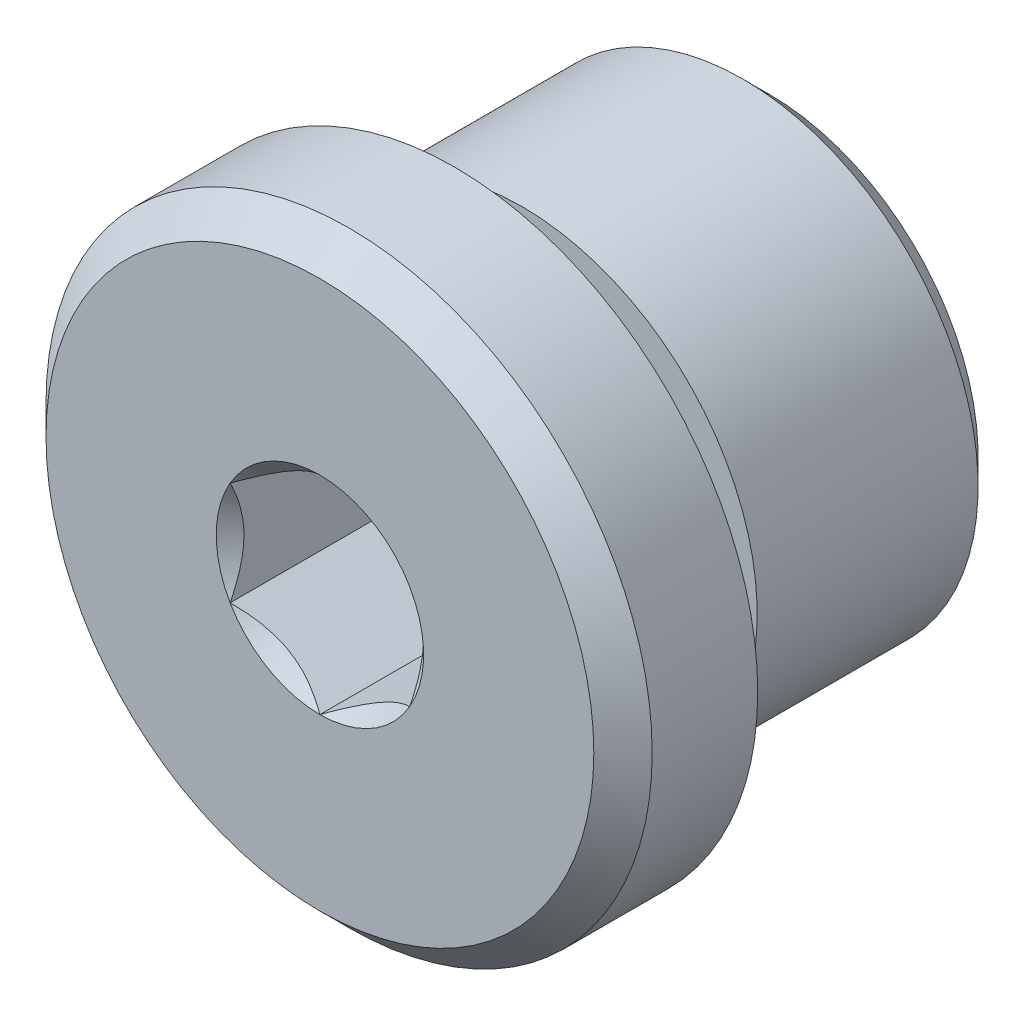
ISO-10303-21;
HEADER;
FILE_DESCRIPTION(('STEP AP214'),'2;1');
FILE_NAME('part.step','',(''),(''),'','','');
FILE_SCHEMA(('AUTOMOTIVE_DESIGN { 1 0 10303 214 1 1 1 1 }'));
ENDSEC;
DATA;
#1=APPLICATION_CONTEXT('core data for automotive mechanical design processes');
#2=APPLICATION_PROTOCOL_DEFINITION('international standard','automotive_design',2000,#1);
#3=PRODUCT_CONTEXT('',#1,'mechanical');
#4=PRODUCT('Part','Part','',(#3));
#5=PRODUCT_RELATED_PRODUCT_CATEGORY('part','',(#4));
#6=PRODUCT_DEFINITION_FORMATION('','',#4);
#7=PRODUCT_DEFINITION_CONTEXT('part definition',#1,'design');
#8=PRODUCT_DEFINITION('design','',#6,#7);
#9=PRODUCT_DEFINITION_SHAPE('','',#8);
#10=(LENGTH_UNIT() NAMED_UNIT(*) SI_UNIT(.MILLI.,.METRE.));
#11=(NAMED_UNIT(*) PLANE_ANGLE_UNIT() SI_UNIT($,.RADIAN.));
#12=(NAMED_UNIT(*) SI_UNIT($,.STERADIAN.) SOLID_ANGLE_UNIT());
#13=UNCERTAINTY_MEASURE_WITH_UNIT(LENGTH_MEASURE(1.E-05),#10,'distance_accuracy_value','');
#14=(GEOMETRIC_REPRESENTATION_CONTEXT(3) GLOBAL_UNCERTAINTY_ASSIGNED_CONTEXT((#13)) GLOBAL_UNIT_ASSIGNED_CONTEXT((#10,
#11,#12)) REPRESENTATION_CONTEXT('',''));
#15=CARTESIAN_POINT('',(0.,0.,0.));
#16=DIRECTION('',(0.,0.,1.));
#17=DIRECTION('',(1.,0.,0.));
#18=AXIS2_PLACEMENT_3D('',#15,#16,#17);
#19=CARTESIAN_POINT('',(0.,0.,-4.));
#20=DIRECTION('',(0.,0.,1.));
#21=DIRECTION('',(0.,-1.,0.));
#22=AXIS2_PLACEMENT_3D('',#19,#20,#21);
#23=PLANE('',#22);
#24=DIRECTION('',(-0.866025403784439,0.5,0.));
#25=VECTOR('',#24,1.);
#26=CARTESIAN_POINT('',(4.,2.3094010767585,-4.));
#27=LINE('',#26,#25);
#28=CARTESIAN_POINT('',(4.,2.3094010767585,-4.));
#29=VERTEX_POINT('',#28);
#30=CARTESIAN_POINT('',(0.,4.61880215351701,-4.));
#31=VERTEX_POINT('',#30);
#32=EDGE_CURVE('E64',#29,#31,#27,.T.);
#33=ORIENTED_EDGE('',*,*,#32,.T.);
#34=DIRECTION('',(-0.866025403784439,-0.5,0.));
#35=VECTOR('',#34,1.);
#36=CARTESIAN_POINT('',(0.,4.61880215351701,-4.));
#37=LINE('',#36,#35);
#38=CARTESIAN_POINT('',(-4.,2.3094010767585,-4.));
#39=VERTEX_POINT('',#38);
#40=EDGE_CURVE('E78',#31,#39,#37,.T.);
#41=ORIENTED_EDGE('',*,*,#40,.T.);
#42=DIRECTION('',(0.,-1.,0.));
#43=VECTOR('',#42,1.);
#44=CARTESIAN_POINT('',(-4.,2.3094010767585,-4.));
#45=LINE('',#44,#43);
#46=CARTESIAN_POINT('',(-4.,-2.3094010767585,-4.));
#47=VERTEX_POINT('',#46);
#48=EDGE_CURVE('E81',#39,#47,#45,.T.);
#49=ORIENTED_EDGE('',*,*,#48,.T.);
#50=DIRECTION('',(0.866025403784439,-0.5,0.));
#51=VECTOR('',#50,1.);
#52=CARTESIAN_POINT('',(-4.,-2.3094010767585,-4.));
#53=LINE('',#52,#51);
#54=CARTESIAN_POINT('',(0.,-4.61880215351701,-4.));
#55=VERTEX_POINT('',#54);
#56=EDGE_CURVE('E96',#47,#55,#53,.T.);
#57=ORIENTED_EDGE('',*,*,#56,.T.);
#58=DIRECTION('',(0.866025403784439,0.5,0.));
#59=VECTOR('',#58,1.);
#60=CARTESIAN_POINT('',(0.,-4.61880215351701,-4.));
#61=LINE('',#60,#59);
#62=CARTESIAN_POINT('',(4.,-2.3094010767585,-4.));
#63=VERTEX_POINT('',#62);
#64=EDGE_CURVE('E272',#55,#63,#61,.T.);
#65=ORIENTED_EDGE('',*,*,#64,.T.);
#66=DIRECTION('',(0.,1.,0.));
#67=VECTOR('',#66,1.);
#68=CARTESIAN_POINT('',(4.,-2.3094010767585,-4.));
#69=LINE('',#68,#67);
#70=EDGE_CURVE('E69',#63,#29,#69,.T.);
#71=ORIENTED_EDGE('',*,*,#70,.T.);
#72=EDGE_LOOP('',(#33,#41,#49,#57,#65,#71));
#73=FACE_BOUND('',#72,.T.);
#74=ADVANCED_FACE('F14',(#73),#23,.T.);
#75=CARTESIAN_POINT('',(0.,4.61880215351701,-4.));
#76=DIRECTION('',(-0.5,0.866025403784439,0.));
#77=DIRECTION('',(-0.866025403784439,-0.5,0.));
#78=AXIS2_PLACEMENT_3D('',#75,#76,#77);
#79=PLANE('',#78);
#80=ORIENTED_EDGE('',*,*,#40,.F.);
#81=DIRECTION('',(0.,0.,1.));
#82=VECTOR('',#81,1.);
#83=CARTESIAN_POINT('',(0.,4.61880215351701,-4.));
#84=LINE('',#83,#82);
#85=CARTESIAN_POINT('',(0.,4.61880215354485,5.99999999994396));
#86=VERTEX_POINT('',#85);
#87=EDGE_CURVE('E56',#31,#86,#84,.T.);
#88=ORIENTED_EDGE('',*,*,#87,.T.);
#89=CARTESIAN_POINT('',(3.50611918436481E-11,4.6188021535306,5.99999999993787));
#90=CARTESIAN_POINT('',(-0.0687749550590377,4.57909491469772,5.96029983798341));
#91=CARTESIAN_POINT('',(-0.138076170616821,4.53908383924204,5.92181777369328));
#92=CARTESIAN_POINT('',(-0.277839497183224,4.45839144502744,5.84766109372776));
#93=CARTESIAN_POINT('',(-0.348302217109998,4.41770977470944,5.81198801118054));
#94=CARTESIAN_POINT('',(-0.562249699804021,4.2941871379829,5.70943498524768));
#95=CARTESIAN_POINT('',(-0.707552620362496,4.21029645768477,5.64745868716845));
#96=CARTESIAN_POINT('',(-1.00051065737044,4.04115705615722,5.54132160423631));
#97=CARTESIAN_POINT('',(-1.14809180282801,3.95595104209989,5.49689359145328));
#98=CARTESIAN_POINT('',(-1.44651232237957,3.78365787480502,5.42843759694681));
#99=CARTESIAN_POINT('',(-1.59734256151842,3.6965759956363,5.40435855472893));
#100=CARTESIAN_POINT('',(-1.85730247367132,3.54648807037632,5.38263320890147));
#101=CARTESIAN_POINT('',(-1.96609737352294,3.48367530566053,5.37941854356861));
#102=CARTESIAN_POINT('',(-2.18351048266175,3.35815178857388,5.38484214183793));
#103=CARTESIAN_POINT('',(-2.29212861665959,3.29544107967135,5.39348455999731));
#104=CARTESIAN_POINT('',(-2.50833558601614,3.17061392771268,5.42212936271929));
#105=CARTESIAN_POINT('',(-2.6159231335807,3.10849822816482,5.44214444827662));
#106=CARTESIAN_POINT('',(-2.82925043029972,2.9853336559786,5.49244202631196));
#107=CARTESIAN_POINT('',(-2.93499032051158,2.9242847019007,5.52272373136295));
#108=CARTESIAN_POINT('',(-3.1226843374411,2.81591951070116,5.58501828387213));
#109=CARTESIAN_POINT('',(-3.20505440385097,2.76836313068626,5.61539181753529));
#110=CARTESIAN_POINT('',(-3.36831619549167,2.67410389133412,5.68103271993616));
#111=CARTESIAN_POINT('',(-3.44920787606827,2.62740105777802,5.71630023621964));
#112=CARTESIAN_POINT('',(-3.60925800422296,2.53499607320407,5.7909387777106));
#113=CARTESIAN_POINT('',(-3.6884210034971,2.48929129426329,5.83029689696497));
#114=CARTESIAN_POINT('',(-3.84528136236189,2.39872792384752,5.91260007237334));
#115=CARTESIAN_POINT('',(-3.92297958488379,2.35386883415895,5.95554293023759));
#116=CARTESIAN_POINT('',(-4.00000000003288,2.30940107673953,5.99999999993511));
#117=B_SPLINE_CURVE_WITH_KNOTS('',3,(#89,#90,#91,#92,#93,#94,#95,#96,#97,#98,#99,#100,#101,#102,
#103,#104,#105,#106,#107,#108,#109,#110,#111,#112,#113,#114,#115,#116),.UNSPECIFIED.,.F.,.F.,(4,
2,2,2,2,2,2,2,2,2,2,2,2,4),(0.,0.266334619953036,0.53281361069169,1.06864799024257,
1.59597513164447,2.12197511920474,2.49844327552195,2.87504337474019,3.25206488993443,
3.62905749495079,3.92845163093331,4.22785479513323,4.52634046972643,4.82464442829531),.UNSPECIFIED.);
#118=CARTESIAN_POINT('',(-4.00000000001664,2.30940107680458,5.99999999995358));
#119=VERTEX_POINT('',#118);
#120=EDGE_CURVE('E17',#86,#119,#117,.T.);
#121=ORIENTED_EDGE('',*,*,#120,.T.);
#122=DIRECTION('',(0.,0.,1.));
#123=VECTOR('',#122,1.);
#124=CARTESIAN_POINT('',(-4.,2.3094010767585,-4.));
#125=LINE('',#124,#123);
#126=EDGE_CURVE('E83',#119,#39,#125,.F.);
#127=ORIENTED_EDGE('',*,*,#126,.T.);
#128=EDGE_LOOP('',(#80,#88,#121,#127));
#129=FACE_BOUND('',#128,.T.);
#130=ADVANCED_FACE('F86',(#129),#79,.F.);
#131=CARTESIAN_POINT('',(-4.,2.3094010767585,-4.));
#132=DIRECTION('',(-1.,0.,0.));
#133=DIRECTION('',(0.,-1.,0.));
#134=AXIS2_PLACEMENT_3D('',#131,#132,#133);
#135=PLANE('',#134);
#136=ORIENTED_EDGE('',*,*,#48,.F.);
#137=ORIENTED_EDGE('',*,*,#126,.F.);
#138=CARTESIAN_POINT('',(-3.99999999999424,2.30940107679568,5.99999999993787));
#139=CARTESIAN_POINT('',(-3.99999999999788,2.22998659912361,5.96029983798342));
#140=CARTESIAN_POINT('',(-3.99999999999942,2.14996444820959,5.92181777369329));
#141=CARTESIAN_POINT('',(-4.00000000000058,1.98857965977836,5.84766109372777));
#142=CARTESIAN_POINT('',(-4.0000000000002,1.90721631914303,5.81198801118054));
#143=CARTESIAN_POINT('',(-3.99999999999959,1.660171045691,5.70943498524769));
#144=CARTESIAN_POINT('',(-3.99999999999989,1.49238968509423,5.64745868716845));
#145=CARTESIAN_POINT('',(-4.00000000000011,1.15411088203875,5.54132160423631));
#146=CARTESIAN_POINT('',(-4.00000000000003,0.983698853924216,5.49689359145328));
#147=CARTESIAN_POINT('',(-3.99999999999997,0.63911251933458,5.42843759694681));
#148=CARTESIAN_POINT('',(-3.99999999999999,0.464948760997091,5.40435855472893));
#149=CARTESIAN_POINT('',(-4.,0.164772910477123,5.38263320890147));
#150=CARTESIAN_POINT('',(-4.,0.0391473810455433,5.37941854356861));
#151=CARTESIAN_POINT('',(-4.,-0.211899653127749,5.38484214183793));
#152=CARTESIAN_POINT('',(-4.,-0.337321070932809,5.3934845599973));
#153=CARTESIAN_POINT('',(-4.,-0.586975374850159,5.42212936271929));
#154=CARTESIAN_POINT('',(-4.,-0.711206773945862,5.44214444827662));
#155=CARTESIAN_POINT('',(-4.,-0.957535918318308,5.49244202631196));
#156=CARTESIAN_POINT('',(-4.,-1.07963382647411,5.52272373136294));
#157=CARTESIAN_POINT('',(-4.,-1.29636420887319,5.58501828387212));
#158=CARTESIAN_POINT('',(-4.,-1.391476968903,5.61539181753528));
#159=CARTESIAN_POINT('',(-4.,-1.57999544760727,5.68103271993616));
#160=CARTESIAN_POINT('',(-4.,-1.67340111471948,5.71630023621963));
#161=CARTESIAN_POINT('',(-4.,-1.85821108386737,5.7909387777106));
#162=CARTESIAN_POINT('',(-4.,-1.94962064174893,5.83029689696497));
#163=CARTESIAN_POINT('',(-4.,-2.13074738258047,5.91260007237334));
#164=CARTESIAN_POINT('',(-4.,-2.22046556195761,5.95554293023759));
#165=CARTESIAN_POINT('',(-4.,-2.30940107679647,5.99999999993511));
#166=B_SPLINE_CURVE_WITH_KNOTS('',3,(#138,#139,#140,#141,#142,#143,#144,#145,#146,#147,#148,
#149,#150,#151,#152,#153,#154,#155,#156,#157,#158,#159,#160,#161,#162,#163,#164,#165),
.UNSPECIFIED.,.F.,.F.,(4,2,2,2,2,2,2,2,2,2,2,2,2,4),(0.,0.266334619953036,0.532813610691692,
1.06864799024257,1.59597513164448,2.12197511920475,2.49844327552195,2.87504337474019,
3.25206488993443,3.62905749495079,3.92845163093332,4.22785479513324,4.52634046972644,
4.82464442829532),.UNSPECIFIED.);
#167=CARTESIAN_POINT('',(-4.00000000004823,-2.30940107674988,5.99999999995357));
#168=VERTEX_POINT('',#167);
#169=EDGE_CURVE('E204',#119,#168,#166,.T.);
#170=ORIENTED_EDGE('',*,*,#169,.T.);
#171=DIRECTION('',(0.,0.,1.));
#172=VECTOR('',#171,1.);
#173=CARTESIAN_POINT('',(-4.,-2.3094010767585,-4.));
#174=LINE('',#173,#172);
#175=EDGE_CURVE('E93',#168,#47,#174,.F.);
#176=ORIENTED_EDGE('',*,*,#175,.T.);
#177=EDGE_LOOP('',(#136,#137,#170,#176));
#178=FACE_BOUND('',#177,.T.);
#179=ADVANCED_FACE('F91',(#178),#135,.F.);
#180=CARTESIAN_POINT('',(-4.,-2.3094010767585,-4.));
#181=DIRECTION('',(-0.5,-0.866025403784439,0.));
#182=DIRECTION('',(0.866025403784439,-0.5,0.));
#183=AXIS2_PLACEMENT_3D('',#180,#181,#182);
#184=PLANE('',#183);
#185=ORIENTED_EDGE('',*,*,#56,.F.);
#186=ORIENTED_EDGE('',*,*,#175,.F.);
#187=CARTESIAN_POINT('',(-4.00000000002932,-2.30940107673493,5.99999999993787));
#188=CARTESIAN_POINT('',(-3.93122504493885,-2.34910831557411,5.96029983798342));
#189=CARTESIAN_POINT('',(-3.86192382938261,-2.38911939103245,5.92181777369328));
#190=CARTESIAN_POINT('',(-3.72216050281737,-2.46981178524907,5.84766109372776));
#191=CARTESIAN_POINT('',(-3.65169778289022,-2.51049345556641,5.81198801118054));
#192=CARTESIAN_POINT('',(-3.43775030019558,-2.6340160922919,5.70943498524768));
#193=CARTESIAN_POINT('',(-3.29244737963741,-2.71790677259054,5.64745868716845));
#194=CARTESIAN_POINT('',(-2.99948934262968,-2.88704617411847,5.54132160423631));
#195=CARTESIAN_POINT('',(-2.85190819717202,-2.97225218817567,5.49689359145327));
#196=CARTESIAN_POINT('',(-2.55348767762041,-3.14454535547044,5.42843759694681));
#197=CARTESIAN_POINT('',(-2.40265743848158,-3.2316272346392,5.40435855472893));
#198=CARTESIAN_POINT('',(-2.14269752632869,-3.3817151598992,5.38263320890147));
#199=CARTESIAN_POINT('',(-2.03390262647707,-3.44452792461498,5.3794185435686));
#200=CARTESIAN_POINT('',(-1.81648951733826,-3.57005144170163,5.38484214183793));
#201=CARTESIAN_POINT('',(-1.70787138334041,-3.63276215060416,5.3934845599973));
#202=CARTESIAN_POINT('',(-1.49166441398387,-3.75758930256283,5.42212936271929));
#203=CARTESIAN_POINT('',(-1.38407686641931,-3.81970500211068,5.44214444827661));
#204=CARTESIAN_POINT('',(-1.17074956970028,-3.94286957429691,5.49244202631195));
#205=CARTESIAN_POINT('',(-1.06500967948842,-4.0039185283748,5.52272373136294));
#206=CARTESIAN_POINT('',(-0.877315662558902,-4.11228371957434,5.58501828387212));
#207=CARTESIAN_POINT('',(-0.79494559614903,-4.15984009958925,5.61539181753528));
#208=CARTESIAN_POINT('',(-0.631683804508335,-4.25409933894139,5.68103271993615));
#209=CARTESIAN_POINT('',(-0.550792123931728,-4.30080217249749,5.71630023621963));
#210=CARTESIAN_POINT('',(-0.390741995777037,-4.39320715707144,5.79093877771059));
#211=CARTESIAN_POINT('',(-0.3115789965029,-4.43891193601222,5.83029689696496));
#212=CARTESIAN_POINT('',(-0.15471863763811,-4.52947530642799,5.91260007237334));
#213=CARTESIAN_POINT('',(-0.0770204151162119,-4.57433439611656,5.95554293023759));
#214=CARTESIAN_POINT('',(3.2885622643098E-11,-4.61880215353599,5.99999999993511));
#215=B_SPLINE_CURVE_WITH_KNOTS('',3,(#187,#188,#189,#190,#191,#192,#193,#194,#195,#196,#197,
#198,#199,#200,#201,#202,#203,#204,#205,#206,#207,#208,#209,#210,#211,#212,#213,#214),
.UNSPECIFIED.,.F.,.F.,(4,2,2,2,2,2,2,2,2,2,2,2,2,4),(0.,0.266334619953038,0.532813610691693,
1.06864799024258,1.59597513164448,2.12197511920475,2.49844327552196,2.8750433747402,
3.25206488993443,3.6290574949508,3.92845163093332,4.22785479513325,4.52634046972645,
4.82464442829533),.UNSPECIFIED.);
#216=CARTESIAN_POINT('',(-3.15715938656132E-11,-4.61880215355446,5.99999999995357));
#217=VERTEX_POINT('',#216);
#218=EDGE_CURVE('E184',#168,#217,#215,.T.);
#219=ORIENTED_EDGE('',*,*,#218,.T.);
#220=DIRECTION('',(0.,0.,1.));
#221=VECTOR('',#220,1.);
#222=CARTESIAN_POINT('',(0.,-4.61880215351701,-4.));
#223=LINE('',#222,#221);
#224=EDGE_CURVE('E273',#217,#55,#223,.F.);
#225=ORIENTED_EDGE('',*,*,#224,.T.);
#226=EDGE_LOOP('',(#185,#186,#219,#225));
#227=FACE_BOUND('',#226,.T.);
#228=ADVANCED_FACE('F194',(#227),#184,.F.);
#229=CARTESIAN_POINT('',(0.,-4.61880215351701,-4.));
#230=DIRECTION('',(0.5,-0.866025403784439,0.));
#231=DIRECTION('',(0.866025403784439,0.5,0.));
#232=AXIS2_PLACEMENT_3D('',#229,#230,#231);
#233=PLANE('',#232);
#234=ORIENTED_EDGE('',*,*,#64,.F.);
#235=ORIENTED_EDGE('',*,*,#224,.F.);
#236=CARTESIAN_POINT('',(-3.50711385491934E-11,-4.61880215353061,5.99999999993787));
#237=CARTESIAN_POINT('',(0.0687749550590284,-4.57909491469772,5.96029983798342));
#238=CARTESIAN_POINT('',(0.138076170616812,-4.53908383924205,5.92181777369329));
#239=CARTESIAN_POINT('',(0.277839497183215,-4.45839144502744,5.84766109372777));
#240=CARTESIAN_POINT('',(0.348302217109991,-4.41770977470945,5.81198801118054));
#241=CARTESIAN_POINT('',(0.562249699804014,-4.2941871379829,5.70943498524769));
#242=CARTESIAN_POINT('',(0.707552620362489,-4.21029645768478,5.64745868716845));
#243=CARTESIAN_POINT('',(1.00051065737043,-4.04115705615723,5.54132160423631));
#244=CARTESIAN_POINT('',(1.14809180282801,-3.95595104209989,5.49689359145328));
#245=CARTESIAN_POINT('',(1.44651232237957,-3.78365787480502,5.42843759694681));
#246=CARTESIAN_POINT('',(1.59734256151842,-3.6965759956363,5.40435855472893));
#247=CARTESIAN_POINT('',(1.85730247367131,-3.54648807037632,5.38263320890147));
#248=CARTESIAN_POINT('',(1.96609737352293,-3.48367530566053,5.37941854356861));
#249=CARTESIAN_POINT('',(2.18351048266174,-3.35815178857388,5.38484214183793));
#250=CARTESIAN_POINT('',(2.29212861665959,-3.29544107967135,5.3934845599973));
#251=CARTESIAN_POINT('',(2.50833558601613,-3.17061392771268,5.42212936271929));
#252=CARTESIAN_POINT('',(2.61592313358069,-3.10849822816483,5.44214444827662));
#253=CARTESIAN_POINT('',(2.82925043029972,-2.9853336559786,5.49244202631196));
#254=CARTESIAN_POINT('',(2.93499032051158,-2.92428470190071,5.52272373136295));
#255=CARTESIAN_POINT('',(3.1226843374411,-2.81591951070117,5.58501828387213));
#256=CARTESIAN_POINT('',(3.20505440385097,-2.76836313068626,5.61539181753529));
#257=CARTESIAN_POINT('',(3.36831619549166,-2.67410389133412,5.68103271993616));
#258=CARTESIAN_POINT('',(3.44920787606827,-2.62740105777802,5.71630023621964));
#259=CARTESIAN_POINT('',(3.60925800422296,-2.53499607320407,5.7909387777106));
#260=CARTESIAN_POINT('',(3.6884210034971,-2.48929129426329,5.83029689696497));
#261=CARTESIAN_POINT('',(3.84528136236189,-2.39872792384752,5.91260007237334));
#262=CARTESIAN_POINT('',(3.92297958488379,-2.35386883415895,5.95554293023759));
#263=CARTESIAN_POINT('',(4.00000000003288,-2.30940107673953,5.99999999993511));
#264=B_SPLINE_CURVE_WITH_KNOTS('',3,(#236,#237,#238,#239,#240,#241,#242,#243,#244,#245,#246,
#247,#248,#249,#250,#251,#252,#253,#254,#255,#256,#257,#258,#259,#260,#261,#262,#263),
.UNSPECIFIED.,.F.,.F.,(4,2,2,2,2,2,2,2,2,2,2,2,2,4),(0.,0.266334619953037,0.532813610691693,
1.06864799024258,1.59597513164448,2.12197511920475,2.49844327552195,2.87504337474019,
3.25206488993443,3.62905749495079,3.92845163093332,4.22785479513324,4.52634046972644,
4.82464442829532),.UNSPECIFIED.);
#265=CARTESIAN_POINT('',(4.00000000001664,-2.30940107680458,5.99999999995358));
#266=VERTEX_POINT('',#265);
#267=EDGE_CURVE('E177',#217,#266,#264,.T.);
#268=ORIENTED_EDGE('',*,*,#267,.T.);
#269=DIRECTION('',(0.,0.,1.));
#270=VECTOR('',#269,1.);
#271=CARTESIAN_POINT('',(4.,-2.3094010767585,-4.));
#272=LINE('',#271,#270);
#273=EDGE_CURVE('E269',#266,#63,#272,.F.);
#274=ORIENTED_EDGE('',*,*,#273,.T.);
#275=EDGE_LOOP('',(#234,#235,#268,#274));
#276=FACE_BOUND('',#275,.T.);
#277=ADVANCED_FACE('F190',(#276),#233,.F.);
#278=CARTESIAN_POINT('',(4.,-2.3094010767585,-4.));
#279=DIRECTION('',(1.,0.,0.));
#280=DIRECTION('',(0.,1.,0.));
#281=AXIS2_PLACEMENT_3D('',#278,#279,#280);
#282=PLANE('',#281);
#283=ORIENTED_EDGE('',*,*,#70,.F.);
#284=ORIENTED_EDGE('',*,*,#273,.F.);
#285=CARTESIAN_POINT('',(3.99999999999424,-2.30940107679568,5.99999999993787));
#286=CARTESIAN_POINT('',(3.99999999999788,-2.22998659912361,5.96029983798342));
#287=CARTESIAN_POINT('',(3.99999999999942,-2.14996444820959,5.92181777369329));
#288=CARTESIAN_POINT('',(4.00000000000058,-1.98857965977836,5.84766109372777));
#289=CARTESIAN_POINT('',(4.0000000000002,-1.90721631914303,5.81198801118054));
#290=CARTESIAN_POINT('',(3.99999999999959,-1.660171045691,5.70943498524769));
#291=CARTESIAN_POINT('',(3.99999999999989,-1.49238968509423,5.64745868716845));
#292=CARTESIAN_POINT('',(4.00000000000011,-1.15411088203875,5.54132160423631));
#293=CARTESIAN_POINT('',(4.00000000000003,-0.983698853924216,5.49689359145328));
#294=CARTESIAN_POINT('',(3.99999999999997,-0.63911251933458,5.42843759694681));
#295=CARTESIAN_POINT('',(3.99999999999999,-0.464948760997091,5.40435855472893));
#296=CARTESIAN_POINT('',(4.,-0.164772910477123,5.38263320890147));
#297=CARTESIAN_POINT('',(4.,-0.0391473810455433,5.37941854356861));
#298=CARTESIAN_POINT('',(4.,0.211899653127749,5.38484214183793));
#299=CARTESIAN_POINT('',(4.,0.337321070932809,5.3934845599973));
#300=CARTESIAN_POINT('',(4.,0.586975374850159,5.42212936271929));
#301=CARTESIAN_POINT('',(4.,0.711206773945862,5.44214444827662));
#302=CARTESIAN_POINT('',(4.,0.957535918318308,5.49244202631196));
#303=CARTESIAN_POINT('',(4.,1.07963382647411,5.52272373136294));
#304=CARTESIAN_POINT('',(4.,1.29636420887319,5.58501828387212));
#305=CARTESIAN_POINT('',(4.,1.391476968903,5.61539181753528));
#306=CARTESIAN_POINT('',(4.,1.57999544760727,5.68103271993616));
#307=CARTESIAN_POINT('',(4.,1.67340111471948,5.71630023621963));
#308=CARTESIAN_POINT('',(4.,1.85821108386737,5.7909387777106));
#309=CARTESIAN_POINT('',(4.,1.94962064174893,5.83029689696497));
#310=CARTESIAN_POINT('',(4.,2.13074738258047,5.91260007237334));
#311=CARTESIAN_POINT('',(4.,2.22046556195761,5.95554293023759));
#312=CARTESIAN_POINT('',(4.,2.30940107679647,5.99999999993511));
#313=B_SPLINE_CURVE_WITH_KNOTS('',3,(#285,#286,#287,#288,#289,#290,#291,#292,#293,#294,#295,
#296,#297,#298,#299,#300,#301,#302,#303,#304,#305,#306,#307,#308,#309,#310,#311,#312),
.UNSPECIFIED.,.F.,.F.,(4,2,2,2,2,2,2,2,2,2,2,2,2,4),(0.,0.266334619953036,0.532813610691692,
1.06864799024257,1.59597513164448,2.12197511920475,2.49844327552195,2.87504337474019,
3.25206488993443,3.62905749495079,3.92845163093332,4.22785479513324,4.52634046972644,
4.82464442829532),.UNSPECIFIED.);
#314=CARTESIAN_POINT('',(4.00000000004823,2.30940107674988,5.99999999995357));
#315=VERTEX_POINT('',#314);
#316=EDGE_CURVE('E37',#266,#315,#313,.T.);
#317=ORIENTED_EDGE('',*,*,#316,.T.);
#318=DIRECTION('',(0.,0.,1.));
#319=VECTOR('',#318,1.);
#320=CARTESIAN_POINT('',(4.,2.3094010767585,-4.));
#321=LINE('',#320,#319);
#322=EDGE_CURVE('E267',#315,#29,#321,.F.);
#323=ORIENTED_EDGE('',*,*,#322,.T.);
#324=EDGE_LOOP('',(#283,#284,#317,#323));
#325=FACE_BOUND('',#324,.T.);
#326=ADVANCED_FACE('F193',(#325),#282,.F.);
#327=CARTESIAN_POINT('',(4.,2.3094010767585,-4.));
#328=DIRECTION('',(0.5,0.866025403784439,0.));
#329=DIRECTION('',(-0.866025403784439,0.5,0.));
#330=AXIS2_PLACEMENT_3D('',#327,#328,#329);
#331=PLANE('',#330);
#332=ORIENTED_EDGE('',*,*,#32,.F.);
#333=ORIENTED_EDGE('',*,*,#322,.F.);
#334=CARTESIAN_POINT('',(4.00000000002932,2.30940107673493,5.99999999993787));
#335=CARTESIAN_POINT('',(3.93122504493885,2.34910831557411,5.96029983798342));
#336=CARTESIAN_POINT('',(3.86192382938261,2.38911939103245,5.92181777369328));
#337=CARTESIAN_POINT('',(3.72216050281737,2.46981178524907,5.84766109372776));
#338=CARTESIAN_POINT('',(3.65169778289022,2.51049345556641,5.81198801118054));
#339=CARTESIAN_POINT('',(3.43775030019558,2.6340160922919,5.70943498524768));
#340=CARTESIAN_POINT('',(3.29244737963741,2.71790677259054,5.64745868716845));
#341=CARTESIAN_POINT('',(2.99948934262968,2.88704617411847,5.54132160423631));
#342=CARTESIAN_POINT('',(2.85190819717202,2.97225218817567,5.49689359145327));
#343=CARTESIAN_POINT('',(2.55348767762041,3.14454535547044,5.42843759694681));
#344=CARTESIAN_POINT('',(2.40265743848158,3.2316272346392,5.40435855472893));
#345=CARTESIAN_POINT('',(2.14269752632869,3.3817151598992,5.38263320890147));
#346=CARTESIAN_POINT('',(2.03390262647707,3.44452792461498,5.3794185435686));
#347=CARTESIAN_POINT('',(1.81648951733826,3.57005144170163,5.38484214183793));
#348=CARTESIAN_POINT('',(1.70787138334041,3.63276215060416,5.3934845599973));
#349=CARTESIAN_POINT('',(1.49166441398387,3.75758930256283,5.42212936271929));
#350=CARTESIAN_POINT('',(1.38407686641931,3.81970500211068,5.44214444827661));
#351=CARTESIAN_POINT('',(1.17074956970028,3.94286957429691,5.49244202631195));
#352=CARTESIAN_POINT('',(1.06500967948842,4.0039185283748,5.52272373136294));
#353=CARTESIAN_POINT('',(0.877315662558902,4.11228371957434,5.58501828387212));
#354=CARTESIAN_POINT('',(0.79494559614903,4.15984009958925,5.61539181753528));
#355=CARTESIAN_POINT('',(0.631683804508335,4.25409933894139,5.68103271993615));
#356=CARTESIAN_POINT('',(0.550792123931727,4.30080217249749,5.71630023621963));
#357=CARTESIAN_POINT('',(0.390741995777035,4.39320715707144,5.7909387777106));
#358=CARTESIAN_POINT('',(0.311578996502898,4.43891193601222,5.83029689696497));
#359=CARTESIAN_POINT('',(0.154718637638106,4.52947530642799,5.91260007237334));
#360=CARTESIAN_POINT('',(0.0770204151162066,4.57433439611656,5.95554293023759));
#361=CARTESIAN_POINT('',(-3.28929245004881E-11,4.61880215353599,5.99999999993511));
#362=B_SPLINE_CURVE_WITH_KNOTS('',3,(#334,#335,#336,#337,#338,#339,#340,#341,#342,#343,#344,
#345,#346,#347,#348,#349,#350,#351,#352,#353,#354,#355,#356,#357,#358,#359,#360,#361),
.UNSPECIFIED.,.F.,.F.,(4,2,2,2,2,2,2,2,2,2,2,2,2,4),(0.,0.266334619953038,0.532813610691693,
1.06864799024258,1.59597513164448,2.12197511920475,2.49844327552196,2.8750433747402,
3.25206488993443,3.62905749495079,3.92845163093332,4.22785479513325,4.52634046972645,
4.82464442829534),.UNSPECIFIED.);
#363=EDGE_CURVE('E140',#315,#86,#362,.T.);
#364=ORIENTED_EDGE('',*,*,#363,.T.);
#365=ORIENTED_EDGE('',*,*,#87,.F.);
#366=EDGE_LOOP('',(#332,#333,#364,#365));
#367=FACE_BOUND('',#366,.T.);
#368=ADVANCED_FACE('F155',(#367),#331,.F.);
#369=CARTESIAN_POINT('',(0.,0.,5.99999999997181));
#370=DIRECTION('',(0.,0.,1.));
#371=DIRECTION('',(0.,-1.,0.));
#372=AXIS2_PLACEMENT_3D('',#369,#370,#371);
#373=CONICAL_SURFACE('',#372,4.61880215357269,0.785398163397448);
#374=ORIENTED_EDGE('',*,*,#120,.F.);
#375=CARTESIAN_POINT('',(0.,0.,5.99999999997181));
#376=DIRECTION('',(0.,0.,1.));
#377=DIRECTION('',(0.,-1.,0.));
#378=AXIS2_PLACEMENT_3D('',#375,#376,#377);
#379=CIRCLE('',#378,4.61880215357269);
#380=EDGE_CURVE('E138',#86,#119,#379,.T.);
#381=ORIENTED_EDGE('',*,*,#380,.T.);
#382=EDGE_LOOP('',(#374,#381));
#383=FACE_BOUND('',#382,.T.);
#384=ADVANCED_FACE('F212',(#383),#373,.F.);
#385=CARTESIAN_POINT('',(0.,0.,5.99999999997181));
#386=DIRECTION('',(0.,0.,1.));
#387=DIRECTION('',(0.,-1.,0.));
#388=AXIS2_PLACEMENT_3D('',#385,#386,#387);
#389=CONICAL_SURFACE('',#388,4.61880215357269,0.785398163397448);
#390=ORIENTED_EDGE('',*,*,#169,.F.);
#391=CARTESIAN_POINT('',(0.,0.,5.99999999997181));
#392=DIRECTION('',(0.,0.,1.));
#393=DIRECTION('',(0.,-1.,0.));
#394=AXIS2_PLACEMENT_3D('',#391,#392,#393);
#395=CIRCLE('',#394,4.61880215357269);
#396=EDGE_CURVE('E135',#119,#168,#395,.T.);
#397=ORIENTED_EDGE('',*,*,#396,.T.);
#398=EDGE_LOOP('',(#390,#397));
#399=FACE_BOUND('',#398,.T.);
#400=ADVANCED_FACE('F209',(#399),#389,.F.);
#401=CARTESIAN_POINT('',(0.,0.,5.99999999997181));
#402=DIRECTION('',(0.,0.,1.));
#403=DIRECTION('',(0.,-1.,0.));
#404=AXIS2_PLACEMENT_3D('',#401,#402,#403);
#405=CONICAL_SURFACE('',#404,4.61880215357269,0.785398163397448);
#406=ORIENTED_EDGE('',*,*,#218,.F.);
#407=CARTESIAN_POINT('',(0.,0.,5.99999999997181));
#408=DIRECTION('',(0.,0.,1.));
#409=DIRECTION('',(0.,-1.,0.));
#410=AXIS2_PLACEMENT_3D('',#407,#408,#409);
#411=CIRCLE('',#410,4.61880215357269);
#412=EDGE_CURVE('E132',#168,#217,#411,.T.);
#413=ORIENTED_EDGE('',*,*,#412,.T.);
#414=EDGE_LOOP('',(#406,#413));
#415=FACE_BOUND('',#414,.T.);
#416=ADVANCED_FACE('F173',(#415),#405,.F.);
#417=CARTESIAN_POINT('',(0.,0.,5.99999999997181));
#418=DIRECTION('',(0.,0.,1.));
#419=DIRECTION('',(0.,-1.,0.));
#420=AXIS2_PLACEMENT_3D('',#417,#418,#419);
#421=CONICAL_SURFACE('',#420,4.61880215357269,0.785398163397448);
#422=ORIENTED_EDGE('',*,*,#267,.F.);
#423=CARTESIAN_POINT('',(0.,0.,5.99999999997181));
#424=DIRECTION('',(0.,0.,1.));
#425=DIRECTION('',(0.,-1.,0.));
#426=AXIS2_PLACEMENT_3D('',#423,#424,#425);
#427=CIRCLE('',#426,4.61880215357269);
#428=EDGE_CURVE('E129',#217,#266,#427,.T.);
#429=ORIENTED_EDGE('',*,*,#428,.T.);
#430=EDGE_LOOP('',(#422,#429));
#431=FACE_BOUND('',#430,.T.);
#432=ADVANCED_FACE('F168',(#431),#421,.F.);
#433=CARTESIAN_POINT('',(0.,0.,5.99999999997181));
#434=DIRECTION('',(0.,0.,1.));
#435=DIRECTION('',(0.,-1.,0.));
#436=AXIS2_PLACEMENT_3D('',#433,#434,#435);
#437=CONICAL_SURFACE('',#436,4.61880215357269,0.785398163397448);
#438=ORIENTED_EDGE('',*,*,#316,.F.);
#439=CARTESIAN_POINT('',(0.,0.,5.99999999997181));
#440=DIRECTION('',(0.,0.,1.));
#441=DIRECTION('',(0.,-1.,0.));
#442=AXIS2_PLACEMENT_3D('',#439,#440,#441);
#443=CIRCLE('',#442,4.61880215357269);
#444=EDGE_CURVE('E126',#266,#315,#443,.T.);
#445=ORIENTED_EDGE('',*,*,#444,.T.);
#446=EDGE_LOOP('',(#438,#445));
#447=FACE_BOUND('',#446,.T.);
#448=ADVANCED_FACE('F162',(#447),#437,.F.);
#449=CARTESIAN_POINT('',(0.,0.,5.99999999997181));
#450=DIRECTION('',(0.,0.,1.));
#451=DIRECTION('',(0.,-1.,0.));
#452=AXIS2_PLACEMENT_3D('',#449,#450,#451);
#453=CONICAL_SURFACE('',#452,4.61880215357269,0.785398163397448);
#454=ORIENTED_EDGE('',*,*,#363,.F.);
#455=CARTESIAN_POINT('',(0.,0.,5.99999999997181));
#456=DIRECTION('',(0.,0.,1.));
#457=DIRECTION('',(0.,-1.,0.));
#458=AXIS2_PLACEMENT_3D('',#455,#456,#457);
#459=CIRCLE('',#458,4.61880215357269);
#460=EDGE_CURVE('E123',#315,#86,#459,.T.);
#461=ORIENTED_EDGE('',*,*,#460,.T.);
#462=EDGE_LOOP('',(#454,#461));
#463=FACE_BOUND('',#462,.T.);
#464=ADVANCED_FACE('F157',(#463),#453,.F.);
#465=CARTESIAN_POINT('',(4.618802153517,0.,6.));
#466=DIRECTION('',(0.,0.,-1.));
#467=DIRECTION('',(0.,1.,0.));
#468=AXIS2_PLACEMENT_3D('',#465,#466,#467);
#469=PLANE('',#468);
#470=ORIENTED_EDGE('',*,*,#444,.F.);
#471=ORIENTED_EDGE('',*,*,#428,.F.);
#472=ORIENTED_EDGE('',*,*,#412,.F.);
#473=ORIENTED_EDGE('',*,*,#396,.F.);
#474=ORIENTED_EDGE('',*,*,#380,.F.);
#475=ORIENTED_EDGE('',*,*,#460,.F.);
#476=EDGE_LOOP('',(#470,#471,#472,#473,#474,#475));
#477=FACE_BOUND('',#476,.T.);
#478=CARTESIAN_POINT('',(0.,0.,6.));
#479=DIRECTION('',(0.,0.,-1.));
#480=DIRECTION('',(0.,1.,0.));
#481=AXIS2_PLACEMENT_3D('',#478,#479,#480);
#482=CIRCLE('',#481,12.2);
#483=CARTESIAN_POINT('',(0.,12.2,6.));
#484=VERTEX_POINT('',#483);
#485=EDGE_CURVE('E120',#484,#484,#482,.T.);
#486=ORIENTED_EDGE('',*,*,#485,.F.);
#487=EDGE_LOOP('',(#486));
#488=FACE_BOUND('',#487,.T.);
#489=ADVANCED_FACE('F161',(#477,#488),#469,.F.);
#490=CARTESIAN_POINT('',(0.,0.,4.7));
#491=DIRECTION('',(0.,0.,-1.));
#492=DIRECTION('',(0.,1.,0.));
#493=AXIS2_PLACEMENT_3D('',#490,#491,#492);
#494=CONICAL_SURFACE('',#493,13.5,0.785398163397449);
#495=ORIENTED_EDGE('',*,*,#485,.T.);
#496=EDGE_LOOP('',(#495));
#497=FACE_BOUND('',#496,.T.);
#498=CARTESIAN_POINT('',(0.,0.,4.7));
#499=DIRECTION('',(0.,0.,1.));
#500=DIRECTION('',(0.,-1.,0.));
#501=AXIS2_PLACEMENT_3D('',#498,#499,#500);
#502=CIRCLE('',#501,13.5);
#503=CARTESIAN_POINT('',(0.,-13.5,4.7));
#504=VERTEX_POINT('',#503);
#505=EDGE_CURVE('E119',#504,#504,#502,.F.);
#506=ORIENTED_EDGE('',*,*,#505,.F.);
#507=EDGE_LOOP('',(#506));
#508=FACE_BOUND('',#507,.T.);
#509=ADVANCED_FACE('F317',(#497,#508),#494,.T.);
#510=CARTESIAN_POINT('',(0.,0.,-14.));
#511=DIRECTION('',(0.,0.,1.));
#512=DIRECTION('',(0.,-1.,0.));
#513=AXIS2_PLACEMENT_3D('',#510,#511,#512);
#514=CYLINDRICAL_SURFACE('',#513,13.5);
#515=ORIENTED_EDGE('',*,*,#505,.T.);
#516=EDGE_LOOP('',(#515));
#517=FACE_BOUND('',#516,.T.);
#518=CARTESIAN_POINT('',(0.,0.,0.));
#519=DIRECTION('',(0.,0.,1.));
#520=DIRECTION('',(0.,-1.,0.));
#521=AXIS2_PLACEMENT_3D('',#518,#519,#520);
#522=CIRCLE('',#521,13.5);
#523=CARTESIAN_POINT('',(0.,-13.5,0.));
#524=VERTEX_POINT('',#523);
#525=EDGE_CURVE('E116',#524,#524,#522,.T.);
#526=ORIENTED_EDGE('',*,*,#525,.T.);
#527=EDGE_LOOP('',(#526));
#528=FACE_BOUND('',#527,.T.);
#529=ADVANCED_FACE('F323',(#517,#528),#514,.T.);
#530=CARTESIAN_POINT('',(13.5,0.,0.));
#531=DIRECTION('',(0.,0.,1.));
#532=DIRECTION('',(0.,-1.,0.));
#533=AXIS2_PLACEMENT_3D('',#530,#531,#532);
#534=PLANE('',#533);
#535=ORIENTED_EDGE('',*,*,#525,.F.);
#536=EDGE_LOOP('',(#535));
#537=FACE_BOUND('',#536,.T.);
#538=CARTESIAN_POINT('',(0.,0.,0.));
#539=DIRECTION('',(0.,0.,-1.));
#540=DIRECTION('',(0.,1.,0.));
#541=AXIS2_PLACEMENT_3D('',#538,#539,#540);
#542=CIRCLE('',#541,10.9454451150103);
#543=CARTESIAN_POINT('',(0.,10.9454451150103,0.));
#544=VERTEX_POINT('',#543);
#545=EDGE_CURVE('E113',#544,#544,#542,.T.);
#546=ORIENTED_EDGE('',*,*,#545,.F.);
#547=EDGE_LOOP('',(#546));
#548=FACE_BOUND('',#547,.T.);
#549=ADVANCED_FACE('F254',(#537,#548),#534,.F.);
#550=CARTESIAN_POINT('',(0.,0.,0.35));
#551=DIRECTION('',(0.,0.,-1.));
#552=DIRECTION('',(0.,1.,0.));
#553=AXIS2_PLACEMENT_3D('',#550,#551,#552);
#554=TOROIDAL_SURFACE('',#553,9.85,1.15);
#555=CARTESIAN_POINT('',(0.,0.,0.));
#556=DIRECTION('',(0.,0.,-1.));
#557=DIRECTION('',(0.,1.,0.));
#558=AXIS2_PLACEMENT_3D('',#555,#556,#557);
#559=CIRCLE('',#558,8.75455488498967);
#560=CARTESIAN_POINT('',(0.,8.75455488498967,0.));
#561=VERTEX_POINT('',#560);
#562=EDGE_CURVE('E110',#561,#561,#559,.F.);
#563=ORIENTED_EDGE('',*,*,#562,.T.);
#564=EDGE_LOOP('',(#563));
#565=FACE_BOUND('',#564,.T.);
#566=ORIENTED_EDGE('',*,*,#545,.T.);
#567=EDGE_LOOP('',(#566));
#568=FACE_BOUND('',#567,.T.);
#569=ADVANCED_FACE('F249',(#565,#568),#554,.T.);
#570=CARTESIAN_POINT('',(13.5,0.,0.));
#571=DIRECTION('',(0.,0.,1.));
#572=DIRECTION('',(0.,-1.,0.));
#573=AXIS2_PLACEMENT_3D('',#570,#571,#572);
#574=PLANE('',#573);
#575=ORIENTED_EDGE('',*,*,#562,.F.);
#576=EDGE_LOOP('',(#575));
#577=FACE_BOUND('',#576,.T.);
#578=CARTESIAN_POINT('',(0.,0.,0.));
#579=DIRECTION('',(0.,0.,1.));
#580=DIRECTION('',(0.,-1.,0.));
#581=AXIS2_PLACEMENT_3D('',#578,#579,#580);
#582=CIRCLE('',#581,8.7);
#583=CARTESIAN_POINT('',(0.,-8.7,0.));
#584=VERTEX_POINT('',#583);
#585=EDGE_CURVE('E107',#584,#584,#582,.F.);
#586=ORIENTED_EDGE('',*,*,#585,.F.);
#587=EDGE_LOOP('',(#586));
#588=FACE_BOUND('',#587,.T.);
#589=ADVANCED_FACE('F245',(#577,#588),#574,.F.);
#590=CARTESIAN_POINT('',(9.3155,0.,-14.));
#591=DIRECTION('',(0.,0.,1.));
#592=DIRECTION('',(0.,-1.,0.));
#593=AXIS2_PLACEMENT_3D('',#590,#591,#592);
#594=PLANE('',#593);
#595=CARTESIAN_POINT('',(0.,0.,-14.));
#596=DIRECTION('',(0.,0.,1.));
#597=DIRECTION('',(0.,-1.,0.));
#598=AXIS2_PLACEMENT_3D('',#595,#596,#597);
#599=CIRCLE('',#598,9.3155);
#600=CARTESIAN_POINT('',(0.,-9.3155,-14.));
#601=VERTEX_POINT('',#600);
#602=EDGE_CURVE('E104',#601,#601,#599,.T.);
#603=ORIENTED_EDGE('',*,*,#602,.F.);
#604=EDGE_LOOP('',(#603));
#605=FACE_BOUND('',#604,.T.);
#606=ADVANCED_FACE('F241',(#605),#594,.F.);
#607=CARTESIAN_POINT('',(0.,0.,-14.));
#608=DIRECTION('',(0.,0.,1.));
#609=DIRECTION('',(0.,-1.,0.));
#610=AXIS2_PLACEMENT_3D('',#607,#608,#609);
#611=CYLINDRICAL_SURFACE('',#610,8.7);
#612=ORIENTED_EDGE('',*,*,#585,.T.);
#613=EDGE_LOOP('',(#612));
#614=FACE_BOUND('',#613,.T.);
#615=CARTESIAN_POINT('',(0.,0.,-3.));
#616=DIRECTION('',(0.,0.,1.));
#617=DIRECTION('',(0.,-1.,0.));
#618=AXIS2_PLACEMENT_3D('',#615,#616,#617);
#619=CIRCLE('',#618,8.7);
#620=CARTESIAN_POINT('',(0.,-8.7,-3.));
#621=VERTEX_POINT('',#620);
#622=EDGE_CURVE('E101',#621,#621,#619,.T.);
#623=ORIENTED_EDGE('',*,*,#622,.T.);
#624=EDGE_LOOP('',(#623));
#625=FACE_BOUND('',#624,.T.);
#626=ADVANCED_FACE('F237',(#614,#625),#611,.T.);
#627=CARTESIAN_POINT('',(0.,0.,-12.838));
#628=DIRECTION('',(0.,0.,1.));
#629=DIRECTION('',(0.,-1.,0.));
#630=AXIS2_PLACEMENT_3D('',#627,#628,#629);
#631=CONICAL_SURFACE('',#630,10.4775,0.785398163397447);
#632=CARTESIAN_POINT('',(0.,0.,-12.838));
#633=DIRECTION('',(0.,0.,1.));
#634=DIRECTION('',(0.,-1.,0.));
#635=AXIS2_PLACEMENT_3D('',#632,#633,#634);
#636=CIRCLE('',#635,10.4775);
#637=CARTESIAN_POINT('',(0.,-10.4775,-12.838));
#638=VERTEX_POINT('',#637);
#639=EDGE_CURVE('E28',#638,#638,#636,.T.);
#640=ORIENTED_EDGE('',*,*,#639,.F.);
#641=EDGE_LOOP('',(#640));
#642=FACE_BOUND('',#641,.T.);
#643=ORIENTED_EDGE('',*,*,#602,.T.);
#644=EDGE_LOOP('',(#643));
#645=FACE_BOUND('',#644,.T.);
#646=ADVANCED_FACE('F230',(#642,#645),#631,.T.);
#647=CARTESIAN_POINT('',(8.7,0.,-3.));
#648=DIRECTION('',(0.,0.,-1.));
#649=DIRECTION('',(0.,1.,0.));
#650=AXIS2_PLACEMENT_3D('',#647,#648,#649);
#651=PLANE('',#650);
#652=ORIENTED_EDGE('',*,*,#622,.F.);
#653=EDGE_LOOP('',(#652));
#654=FACE_BOUND('',#653,.T.);
#655=CARTESIAN_POINT('',(0.,0.,-3.));
#656=DIRECTION('',(0.,0.,1.));
#657=DIRECTION('',(0.,-1.,0.));
#658=AXIS2_PLACEMENT_3D('',#655,#656,#657);
#659=CIRCLE('',#658,10.4775);
#660=CARTESIAN_POINT('',(0.,-10.4775,-3.));
#661=VERTEX_POINT('',#660);
#662=EDGE_CURVE('E9',#661,#661,#659,.F.);
#663=ORIENTED_EDGE('',*,*,#662,.F.);
#664=EDGE_LOOP('',(#663));
#665=FACE_BOUND('',#664,.T.);
#666=ADVANCED_FACE('F224',(#654,#665),#651,.F.);
#667=CARTESIAN_POINT('',(0.,0.,-14.));
#668=DIRECTION('',(0.,0.,1.));
#669=DIRECTION('',(0.,-1.,0.));
#670=AXIS2_PLACEMENT_3D('',#667,#668,#669);
#671=CYLINDRICAL_SURFACE('',#670,10.4775);
#672=ORIENTED_EDGE('',*,*,#662,.T.);
#673=EDGE_LOOP('',(#672));
#674=FACE_BOUND('',#673,.T.);
#675=ORIENTED_EDGE('',*,*,#639,.T.);
#676=EDGE_LOOP('',(#675));
#677=FACE_BOUND('',#676,.T.);
#678=ADVANCED_FACE('F222',(#674,#677),#671,.T.);
#679=CLOSED_SHELL('',(#74,#130,#179,#228,#277,#326,#368,#384,#400,#416,#432,#448,#464,#489,#509,
#529,#549,#569,#589,#606,#626,#646,#666,#678));
#680=MANIFOLD_SOLID_BREP('B1',#679);
#681=ADVANCED_BREP_SHAPE_REPRESENTATION('',(#18,#680),#14);
#682=SHAPE_DEFINITION_REPRESENTATION(#9,#681);
ENDSEC;
END-ISO-10303-21;
